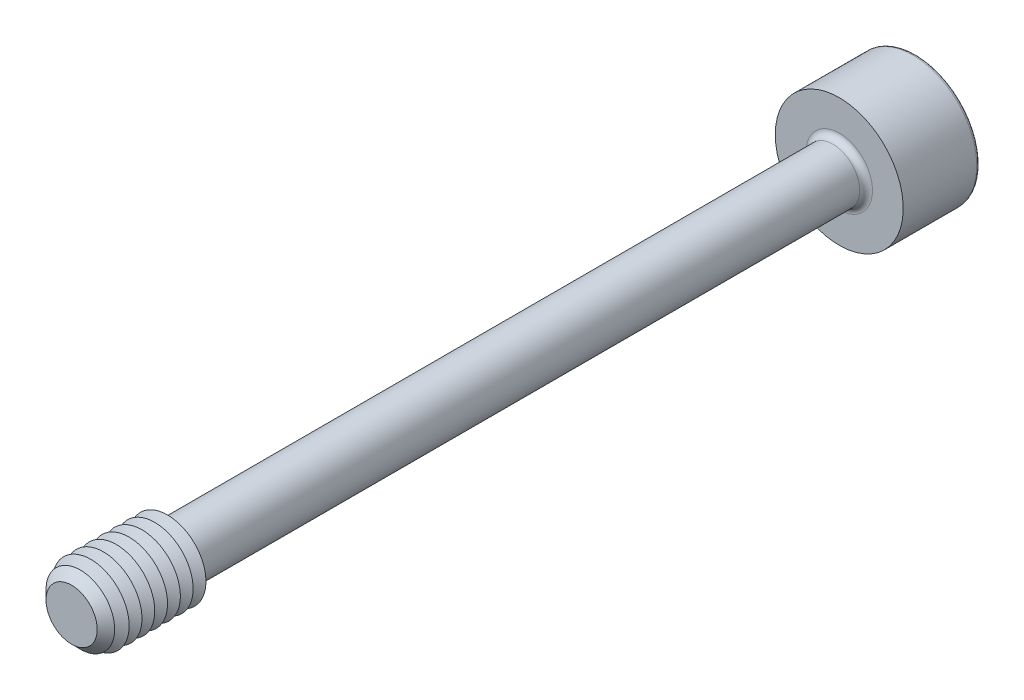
ISO-10303-21;
HEADER;
FILE_DESCRIPTION(('STEP AP214'),'2;1');
FILE_NAME('part.step','',(''),(''),'','','');
FILE_SCHEMA(('AUTOMOTIVE_DESIGN { 1 0 10303 214 1 1 1 1 }'));
ENDSEC;
DATA;
#1=APPLICATION_CONTEXT('core data for automotive mechanical design processes');
#2=APPLICATION_PROTOCOL_DEFINITION('international standard','automotive_design',2000,#1);
#3=PRODUCT_CONTEXT('',#1,'mechanical');
#4=PRODUCT('Part','Part','',(#3));
#5=PRODUCT_RELATED_PRODUCT_CATEGORY('part','',(#4));
#6=PRODUCT_DEFINITION_FORMATION('','',#4);
#7=PRODUCT_DEFINITION_CONTEXT('part definition',#1,'design');
#8=PRODUCT_DEFINITION('design','',#6,#7);
#9=PRODUCT_DEFINITION_SHAPE('','',#8);
#10=(LENGTH_UNIT() NAMED_UNIT(*) SI_UNIT(.MILLI.,.METRE.));
#11=(NAMED_UNIT(*) PLANE_ANGLE_UNIT() SI_UNIT($,.RADIAN.));
#12=(NAMED_UNIT(*) SI_UNIT($,.STERADIAN.) SOLID_ANGLE_UNIT());
#13=UNCERTAINTY_MEASURE_WITH_UNIT(LENGTH_MEASURE(1.E-05),#10,'distance_accuracy_value','');
#14=(GEOMETRIC_REPRESENTATION_CONTEXT(3) GLOBAL_UNCERTAINTY_ASSIGNED_CONTEXT((#13)) GLOBAL_UNIT_ASSIGNED_CONTEXT((#10,
#11,#12)) REPRESENTATION_CONTEXT('',''));
#15=CARTESIAN_POINT('',(0.,0.,0.));
#16=DIRECTION('',(0.,0.,1.));
#17=DIRECTION('',(1.,0.,0.));
#18=AXIS2_PLACEMENT_3D('',#15,#16,#17);
#19=CARTESIAN_POINT('',(-1.44337567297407,-2.5,-31.));
#20=DIRECTION('',(0.,0.,1.));
#21=DIRECTION('',(1.,0.,0.));
#22=AXIS2_PLACEMENT_3D('',#19,#20,#21);
#23=PLANE('',#22);
#24=DIRECTION('',(1.,0.,0.));
#25=VECTOR('',#24,1.);
#26=CARTESIAN_POINT('',(-1.44337567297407,-2.5,-31.));
#27=LINE('',#26,#25);
#28=CARTESIAN_POINT('',(0.,-2.5,-31.));
#29=VERTEX_POINT('',#28);
#30=CARTESIAN_POINT('',(1.44337567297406,-2.5,-31.));
#31=VERTEX_POINT('',#30);
#32=EDGE_CURVE('E729',#29,#31,#27,.T.);
#33=ORIENTED_EDGE('',*,*,#32,.F.);
#34=CARTESIAN_POINT('',(0.,0.,-31.));
#35=DIRECTION('',(0.,0.,1.));
#36=DIRECTION('',(0.,-1.,0.));
#37=AXIS2_PLACEMENT_3D('',#34,#35,#36);
#38=CIRCLE('',#37,2.5);
#39=CARTESIAN_POINT('',(2.1650635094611,-1.25,-31.));
#40=VERTEX_POINT('',#39);
#41=EDGE_CURVE('E53',#29,#40,#38,.T.);
#42=ORIENTED_EDGE('',*,*,#41,.T.);
#43=DIRECTION('',(0.5,0.866025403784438,0.));
#44=VECTOR('',#43,1.);
#45=CARTESIAN_POINT('',(1.44337567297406,-2.5,-31.));
#46=LINE('',#45,#44);
#47=EDGE_CURVE('E714',#31,#40,#46,.T.);
#48=ORIENTED_EDGE('',*,*,#47,.F.);
#49=EDGE_LOOP('',(#33,#42,#48));
#50=FACE_BOUND('',#49,.T.);
#51=ADVANCED_FACE('F41',(#50),#23,.F.);
#52=CARTESIAN_POINT('',(2.88675134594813,0.,-31.));
#53=VERTEX_POINT('',#52);
#54=EDGE_CURVE('E725',#40,#53,#46,.T.);
#55=ORIENTED_EDGE('',*,*,#54,.F.);
#56=CARTESIAN_POINT('',(2.1650635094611,1.25,-31.));
#57=VERTEX_POINT('',#56);
#58=EDGE_CURVE('E11',#40,#57,#38,.T.);
#59=ORIENTED_EDGE('',*,*,#58,.T.);
#60=DIRECTION('',(-0.5,0.866025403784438,0.));
#61=VECTOR('',#60,1.);
#62=CARTESIAN_POINT('',(2.88675134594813,0.,-31.));
#63=LINE('',#62,#61);
#64=EDGE_CURVE('E713',#53,#57,#63,.T.);
#65=ORIENTED_EDGE('',*,*,#64,.F.);
#66=EDGE_LOOP('',(#55,#59,#65));
#67=FACE_BOUND('',#66,.T.);
#68=ADVANCED_FACE('F133',(#67),#23,.F.);
#69=CARTESIAN_POINT('',(1.44337567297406,2.5,-31.));
#70=VERTEX_POINT('',#69);
#71=EDGE_CURVE('E708',#57,#70,#63,.T.);
#72=ORIENTED_EDGE('',*,*,#71,.F.);
#73=CARTESIAN_POINT('',(0.,2.5,-31.));
#74=VERTEX_POINT('',#73);
#75=EDGE_CURVE('E51',#57,#74,#38,.T.);
#76=ORIENTED_EDGE('',*,*,#75,.T.);
#77=DIRECTION('',(-1.,0.,0.));
#78=VECTOR('',#77,1.);
#79=CARTESIAN_POINT('',(1.44337567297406,2.5,-31.));
#80=LINE('',#79,#78);
#81=EDGE_CURVE('E177',#70,#74,#80,.T.);
#82=ORIENTED_EDGE('',*,*,#81,.F.);
#83=EDGE_LOOP('',(#72,#76,#82));
#84=FACE_BOUND('',#83,.T.);
#85=ADVANCED_FACE('F139',(#84),#23,.F.);
#86=CARTESIAN_POINT('',(-1.44337567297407,2.5,-31.));
#87=VERTEX_POINT('',#86);
#88=EDGE_CURVE('E719',#74,#87,#80,.T.);
#89=ORIENTED_EDGE('',*,*,#88,.F.);
#90=CARTESIAN_POINT('',(-2.1650635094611,1.25,-31.));
#91=VERTEX_POINT('',#90);
#92=EDGE_CURVE('E263',#74,#91,#38,.T.);
#93=ORIENTED_EDGE('',*,*,#92,.T.);
#94=DIRECTION('',(-0.5,-0.866025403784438,0.));
#95=VECTOR('',#94,1.);
#96=CARTESIAN_POINT('',(-1.44337567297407,2.5,-31.));
#97=LINE('',#96,#95);
#98=EDGE_CURVE('E176',#87,#91,#97,.T.);
#99=ORIENTED_EDGE('',*,*,#98,.F.);
#100=EDGE_LOOP('',(#89,#93,#99));
#101=FACE_BOUND('',#100,.T.);
#102=ADVANCED_FACE('F157',(#101),#23,.F.);
#103=CARTESIAN_POINT('',(-2.88675134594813,0.,-31.));
#104=VERTEX_POINT('',#103);
#105=EDGE_CURVE('E170',#91,#104,#97,.T.);
#106=ORIENTED_EDGE('',*,*,#105,.F.);
#107=CARTESIAN_POINT('',(-2.1650635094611,-1.25,-31.));
#108=VERTEX_POINT('',#107);
#109=EDGE_CURVE('E172',#91,#108,#38,.T.);
#110=ORIENTED_EDGE('',*,*,#109,.T.);
#111=DIRECTION('',(0.5,-0.866025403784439,0.));
#112=VECTOR('',#111,1.);
#113=CARTESIAN_POINT('',(-2.88675134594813,0.,-31.));
#114=LINE('',#113,#112);
#115=EDGE_CURVE('E174',#104,#108,#114,.T.);
#116=ORIENTED_EDGE('',*,*,#115,.F.);
#117=EDGE_LOOP('',(#106,#110,#116));
#118=FACE_BOUND('',#117,.T.);
#119=ADVANCED_FACE('F146',(#118),#23,.F.);
#120=CARTESIAN_POINT('',(0.,0.,-36.));
#121=DIRECTION('',(0.,0.,-1.));
#122=DIRECTION('',(-1.,0.,0.));
#123=AXIS2_PLACEMENT_3D('',#120,#121,#122);
#124=PLANE('',#123);
#125=CARTESIAN_POINT('',(0.,0.,-36.));
#126=DIRECTION('',(0.,0.,-1.));
#127=DIRECTION('',(-1.,0.,0.));
#128=AXIS2_PLACEMENT_3D('',#125,#126,#127);
#129=CIRCLE('',#128,4.75);
#130=CARTESIAN_POINT('',(-4.75,0.,-36.));
#131=VERTEX_POINT('',#130);
#132=EDGE_CURVE('E250',#131,#131,#129,.T.);
#133=ORIENTED_EDGE('',*,*,#132,.T.);
#134=EDGE_LOOP('',(#133));
#135=FACE_BOUND('',#134,.T.);
#136=DIRECTION('',(-0.5,-0.866025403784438,0.));
#137=VECTOR('',#136,1.);
#138=CARTESIAN_POINT('',(-1.44337567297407,2.5,-36.));
#139=LINE('',#138,#137);
#140=CARTESIAN_POINT('',(-1.44337567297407,2.5,-36.));
#141=VERTEX_POINT('',#140);
#142=CARTESIAN_POINT('',(-2.88675134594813,0.,-36.));
#143=VERTEX_POINT('',#142);
#144=EDGE_CURVE('E211',#141,#143,#139,.T.);
#145=ORIENTED_EDGE('',*,*,#144,.T.);
#146=DIRECTION('',(0.5,-0.866025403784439,0.));
#147=VECTOR('',#146,1.);
#148=CARTESIAN_POINT('',(-2.88675134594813,0.,-36.));
#149=LINE('',#148,#147);
#150=CARTESIAN_POINT('',(-1.44337567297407,-2.5,-36.));
#151=VERTEX_POINT('',#150);
#152=EDGE_CURVE('E67',#143,#151,#149,.T.);
#153=ORIENTED_EDGE('',*,*,#152,.T.);
#154=DIRECTION('',(1.,0.,0.));
#155=VECTOR('',#154,1.);
#156=CARTESIAN_POINT('',(-1.44337567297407,-2.5,-36.));
#157=LINE('',#156,#155);
#158=CARTESIAN_POINT('',(1.44337567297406,-2.5,-36.));
#159=VERTEX_POINT('',#158);
#160=EDGE_CURVE('E195',#151,#159,#157,.T.);
#161=ORIENTED_EDGE('',*,*,#160,.T.);
#162=DIRECTION('',(0.5,0.866025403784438,0.));
#163=VECTOR('',#162,1.);
#164=CARTESIAN_POINT('',(1.44337567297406,-2.5,-36.));
#165=LINE('',#164,#163);
#166=CARTESIAN_POINT('',(2.88675134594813,0.,-36.));
#167=VERTEX_POINT('',#166);
#168=EDGE_CURVE('E199',#159,#167,#165,.T.);
#169=ORIENTED_EDGE('',*,*,#168,.T.);
#170=DIRECTION('',(-0.5,0.866025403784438,0.));
#171=VECTOR('',#170,1.);
#172=CARTESIAN_POINT('',(2.88675134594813,0.,-36.));
#173=LINE('',#172,#171);
#174=CARTESIAN_POINT('',(1.44337567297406,2.5,-36.));
#175=VERTEX_POINT('',#174);
#176=EDGE_CURVE('E203',#167,#175,#173,.T.);
#177=ORIENTED_EDGE('',*,*,#176,.T.);
#178=DIRECTION('',(-1.,0.,0.));
#179=VECTOR('',#178,1.);
#180=CARTESIAN_POINT('',(1.44337567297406,2.5,-36.));
#181=LINE('',#180,#179);
#182=EDGE_CURVE('E207',#175,#141,#181,.T.);
#183=ORIENTED_EDGE('',*,*,#182,.T.);
#184=EDGE_LOOP('',(#145,#153,#161,#169,#177,#183));
#185=FACE_BOUND('',#184,.T.);
#186=ADVANCED_FACE('F156',(#135,#185),#124,.T.);
#187=CARTESIAN_POINT('',(0.,0.,30.));
#188=DIRECTION('',(0.,0.,-1.));
#189=DIRECTION('',(-1.,0.,0.));
#190=AXIS2_PLACEMENT_3D('',#187,#188,#189);
#191=CYLINDRICAL_SURFACE('',#190,2.1);
#192=CARTESIAN_POINT('',(0.,0.,-29.5));
#193=DIRECTION('',(0.,0.,-1.));
#194=DIRECTION('',(-1.,0.,0.));
#195=AXIS2_PLACEMENT_3D('',#192,#193,#194);
#196=CIRCLE('',#195,2.1);
#197=CARTESIAN_POINT('',(-2.1,0.,-29.5));
#198=VERTEX_POINT('',#197);
#199=EDGE_CURVE('E246',#198,#198,#196,.F.);
#200=ORIENTED_EDGE('',*,*,#199,.T.);
#201=EDGE_LOOP('',(#200));
#202=FACE_BOUND('',#201,.T.);
#203=CARTESIAN_POINT('',(0.,0.,21.9803847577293));
#204=DIRECTION('',(0.,0.,-1.));
#205=DIRECTION('',(0.,1.,0.));
#206=AXIS2_PLACEMENT_3D('',#203,#204,#205);
#207=CIRCLE('',#206,2.1);
#208=CARTESIAN_POINT('',(0.,2.1,21.9803847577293));
#209=VERTEX_POINT('',#208);
#210=EDGE_CURVE('E234',#209,#209,#207,.T.);
#211=ORIENTED_EDGE('',*,*,#210,.T.);
#212=EDGE_LOOP('',(#211));
#213=FACE_BOUND('',#212,.T.);
#214=ADVANCED_FACE('F163',(#202,#213),#191,.T.);
#215=CARTESIAN_POINT('',(0.,0.,21.9803847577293));
#216=DIRECTION('',(0.,0.,1.));
#217=DIRECTION('',(0.,-1.,0.));
#218=AXIS2_PLACEMENT_3D('',#215,#216,#217);
#219=CONICAL_SURFACE('',#218,2.1,1.0471975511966);
#220=CARTESIAN_POINT('',(0.,0.,22.5));
#221=DIRECTION('',(0.,0.,-1.));
#222=DIRECTION('',(-1.,0.,0.));
#223=AXIS2_PLACEMENT_3D('',#220,#221,#222);
#224=CIRCLE('',#223,3.);
#225=CARTESIAN_POINT('',(-3.,0.,22.5));
#226=VERTEX_POINT('',#225);
#227=EDGE_CURVE('E267',#226,#226,#224,.T.);
#228=ORIENTED_EDGE('',*,*,#227,.T.);
#229=EDGE_LOOP('',(#228));
#230=FACE_BOUND('',#229,.T.);
#231=ORIENTED_EDGE('',*,*,#210,.F.);
#232=EDGE_LOOP('',(#231));
#233=FACE_BOUND('',#232,.T.);
#234=ADVANCED_FACE('F485',(#230,#233),#219,.T.);
#235=CARTESIAN_POINT('',(0.,0.,-30.));
#236=DIRECTION('',(0.,0.,-1.));
#237=DIRECTION('',(-1.,0.,0.));
#238=AXIS2_PLACEMENT_3D('',#235,#236,#237);
#239=PLANE('',#238);
#240=CARTESIAN_POINT('',(0.,0.,-30.));
#241=DIRECTION('',(0.,0.,-1.));
#242=DIRECTION('',(-1.,0.,0.));
#243=AXIS2_PLACEMENT_3D('',#240,#241,#242);
#244=CIRCLE('',#243,2.6);
#245=CARTESIAN_POINT('',(-2.6,0.,-30.));
#246=VERTEX_POINT('',#245);
#247=EDGE_CURVE('E242',#246,#246,#244,.T.);
#248=ORIENTED_EDGE('',*,*,#247,.T.);
#249=EDGE_LOOP('',(#248));
#250=FACE_BOUND('',#249,.T.);
#251=CARTESIAN_POINT('',(0.,0.,-30.));
#252=DIRECTION('',(0.,0.,-1.));
#253=DIRECTION('',(-1.,0.,0.));
#254=AXIS2_PLACEMENT_3D('',#251,#252,#253);
#255=CIRCLE('',#254,5.);
#256=CARTESIAN_POINT('',(-5.,0.,-30.));
#257=VERTEX_POINT('',#256);
#258=EDGE_CURVE('E230',#257,#257,#255,.T.);
#259=ORIENTED_EDGE('',*,*,#258,.F.);
#260=EDGE_LOOP('',(#259));
#261=FACE_BOUND('',#260,.T.);
#262=ADVANCED_FACE('F478',(#250,#261),#239,.F.);
#263=CARTESIAN_POINT('',(0.,0.,-36.));
#264=DIRECTION('',(0.,0.,1.));
#265=DIRECTION('',(1.,0.,0.));
#266=AXIS2_PLACEMENT_3D('',#263,#264,#265);
#267=CYLINDRICAL_SURFACE('',#266,5.);
#268=CARTESIAN_POINT('',(0.,0.,-35.75));
#269=DIRECTION('',(0.,0.,-1.));
#270=DIRECTION('',(-1.,0.,0.));
#271=AXIS2_PLACEMENT_3D('',#268,#269,#270);
#272=CIRCLE('',#271,5.);
#273=CARTESIAN_POINT('',(-5.,0.,-35.75));
#274=VERTEX_POINT('',#273);
#275=EDGE_CURVE('E253',#274,#274,#272,.F.);
#276=ORIENTED_EDGE('',*,*,#275,.T.);
#277=EDGE_LOOP('',(#276));
#278=FACE_BOUND('',#277,.T.);
#279=ORIENTED_EDGE('',*,*,#258,.T.);
#280=EDGE_LOOP('',(#279));
#281=FACE_BOUND('',#280,.T.);
#282=ADVANCED_FACE('F484',(#278,#281),#267,.T.);
#283=CARTESIAN_POINT('',(-2.88675134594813,0.,-31.));
#284=DIRECTION('',(0.866025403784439,0.5,0.));
#285=DIRECTION('',(-0.5,0.866025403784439,0.));
#286=AXIS2_PLACEMENT_3D('',#283,#284,#285);
#287=PLANE('',#286);
#288=ORIENTED_EDGE('',*,*,#152,.F.);
#289=DIRECTION('',(0.,0.,-1.));
#290=VECTOR('',#289,1.);
#291=CARTESIAN_POINT('',(-2.88675134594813,0.,-31.));
#292=LINE('',#291,#290);
#293=EDGE_CURVE('E186',#104,#143,#292,.T.);
#294=ORIENTED_EDGE('',*,*,#293,.F.);
#295=ORIENTED_EDGE('',*,*,#115,.T.);
#296=CARTESIAN_POINT('',(-1.44337567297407,-2.5,-31.));
#297=VERTEX_POINT('',#296);
#298=EDGE_CURVE('E214',#108,#297,#114,.T.);
#299=ORIENTED_EDGE('',*,*,#298,.T.);
#300=DIRECTION('',(0.,0.,-1.));
#301=VECTOR('',#300,1.);
#302=CARTESIAN_POINT('',(-1.44337567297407,-2.5,-31.));
#303=LINE('',#302,#301);
#304=EDGE_CURVE('E227',#297,#151,#303,.T.);
#305=ORIENTED_EDGE('',*,*,#304,.T.);
#306=EDGE_LOOP('',(#288,#294,#295,#299,#305));
#307=FACE_BOUND('',#306,.T.);
#308=ADVANCED_FACE('F496',(#307),#287,.T.);
#309=CARTESIAN_POINT('',(-1.44337567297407,-2.5,-31.));
#310=DIRECTION('',(0.,1.,0.));
#311=DIRECTION('',(-1.,0.,0.));
#312=AXIS2_PLACEMENT_3D('',#309,#310,#311);
#313=PLANE('',#312);
#314=ORIENTED_EDGE('',*,*,#160,.F.);
#315=ORIENTED_EDGE('',*,*,#304,.F.);
#316=EDGE_CURVE('E726',#297,#29,#27,.T.);
#317=ORIENTED_EDGE('',*,*,#316,.T.);
#318=ORIENTED_EDGE('',*,*,#32,.T.);
#319=DIRECTION('',(0.,0.,-1.));
#320=VECTOR('',#319,1.);
#321=CARTESIAN_POINT('',(1.44337567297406,-2.5,-31.));
#322=LINE('',#321,#320);
#323=EDGE_CURVE('E224',#31,#159,#322,.T.);
#324=ORIENTED_EDGE('',*,*,#323,.T.);
#325=EDGE_LOOP('',(#314,#315,#317,#318,#324));
#326=FACE_BOUND('',#325,.T.);
#327=ADVANCED_FACE('F512',(#326),#313,.T.);
#328=CARTESIAN_POINT('',(1.44337567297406,-2.5,-31.));
#329=DIRECTION('',(-0.866025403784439,0.5,0.));
#330=DIRECTION('',(-0.5,-0.866025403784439,0.));
#331=AXIS2_PLACEMENT_3D('',#328,#329,#330);
#332=PLANE('',#331);
#333=ORIENTED_EDGE('',*,*,#168,.F.);
#334=ORIENTED_EDGE('',*,*,#323,.F.);
#335=ORIENTED_EDGE('',*,*,#47,.T.);
#336=ORIENTED_EDGE('',*,*,#54,.T.);
#337=DIRECTION('',(0.,0.,-1.));
#338=VECTOR('',#337,1.);
#339=CARTESIAN_POINT('',(2.88675134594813,0.,-31.));
#340=LINE('',#339,#338);
#341=EDGE_CURVE('E221',#53,#167,#340,.T.);
#342=ORIENTED_EDGE('',*,*,#341,.T.);
#343=EDGE_LOOP('',(#333,#334,#335,#336,#342));
#344=FACE_BOUND('',#343,.T.);
#345=ADVANCED_FACE('F522',(#344),#332,.T.);
#346=CARTESIAN_POINT('',(2.88675134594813,0.,-31.));
#347=DIRECTION('',(-0.866025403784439,-0.5,0.));
#348=DIRECTION('',(0.5,-0.866025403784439,0.));
#349=AXIS2_PLACEMENT_3D('',#346,#347,#348);
#350=PLANE('',#349);
#351=ORIENTED_EDGE('',*,*,#176,.F.);
#352=ORIENTED_EDGE('',*,*,#341,.F.);
#353=ORIENTED_EDGE('',*,*,#64,.T.);
#354=ORIENTED_EDGE('',*,*,#71,.T.);
#355=DIRECTION('',(0.,0.,-1.));
#356=VECTOR('',#355,1.);
#357=CARTESIAN_POINT('',(1.44337567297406,2.5,-31.));
#358=LINE('',#357,#356);
#359=EDGE_CURVE('E218',#70,#175,#358,.T.);
#360=ORIENTED_EDGE('',*,*,#359,.T.);
#361=EDGE_LOOP('',(#351,#352,#353,#354,#360));
#362=FACE_BOUND('',#361,.T.);
#363=ADVANCED_FACE('F532',(#362),#350,.T.);
#364=CARTESIAN_POINT('',(1.44337567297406,2.5,-31.));
#365=DIRECTION('',(0.,-1.,0.));
#366=DIRECTION('',(0.,0.,-1.));
#367=AXIS2_PLACEMENT_3D('',#364,#365,#366);
#368=PLANE('',#367);
#369=ORIENTED_EDGE('',*,*,#182,.F.);
#370=ORIENTED_EDGE('',*,*,#359,.F.);
#371=ORIENTED_EDGE('',*,*,#81,.T.);
#372=ORIENTED_EDGE('',*,*,#88,.T.);
#373=DIRECTION('',(0.,0.,-1.));
#374=VECTOR('',#373,1.);
#375=CARTESIAN_POINT('',(-1.44337567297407,2.5,-31.));
#376=LINE('',#375,#374);
#377=EDGE_CURVE('E182',#87,#141,#376,.T.);
#378=ORIENTED_EDGE('',*,*,#377,.T.);
#379=EDGE_LOOP('',(#369,#370,#371,#372,#378));
#380=FACE_BOUND('',#379,.T.);
#381=ADVANCED_FACE('F152',(#380),#368,.T.);
#382=CARTESIAN_POINT('',(-1.44337567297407,2.5,-31.));
#383=DIRECTION('',(0.866025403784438,-0.5,0.));
#384=DIRECTION('',(0.5,0.866025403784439,0.));
#385=AXIS2_PLACEMENT_3D('',#382,#383,#384);
#386=PLANE('',#385);
#387=ORIENTED_EDGE('',*,*,#144,.F.);
#388=ORIENTED_EDGE('',*,*,#377,.F.);
#389=ORIENTED_EDGE('',*,*,#98,.T.);
#390=ORIENTED_EDGE('',*,*,#105,.T.);
#391=ORIENTED_EDGE('',*,*,#293,.T.);
#392=EDGE_LOOP('',(#387,#388,#389,#390,#391));
#393=FACE_BOUND('',#392,.T.);
#394=ADVANCED_FACE('F144',(#393),#386,.T.);
#395=ORIENTED_EDGE('',*,*,#298,.F.);
#396=EDGE_CURVE('E255',#108,#29,#38,.T.);
#397=ORIENTED_EDGE('',*,*,#396,.T.);
#398=ORIENTED_EDGE('',*,*,#316,.F.);
#399=EDGE_LOOP('',(#395,#397,#398));
#400=FACE_BOUND('',#399,.T.);
#401=ADVANCED_FACE('F135',(#400),#23,.F.);
#402=CARTESIAN_POINT('',(0.,0.,-29.5));
#403=DIRECTION('',(0.,0.,-1.));
#404=DIRECTION('',(-1.,0.,0.));
#405=AXIS2_PLACEMENT_3D('',#402,#403,#404);
#406=TOROIDAL_SURFACE('',#405,2.6,0.5);
#407=ORIENTED_EDGE('',*,*,#199,.F.);
#408=EDGE_LOOP('',(#407));
#409=FACE_BOUND('',#408,.T.);
#410=ORIENTED_EDGE('',*,*,#247,.F.);
#411=EDGE_LOOP('',(#410));
#412=FACE_BOUND('',#411,.T.);
#413=ADVANCED_FACE('F129',(#409,#412),#406,.F.);
#414=CARTESIAN_POINT('',(0.,0.,-35.75));
#415=DIRECTION('',(0.,0.,-1.));
#416=DIRECTION('',(-1.,0.,0.));
#417=AXIS2_PLACEMENT_3D('',#414,#415,#416);
#418=TOROIDAL_SURFACE('',#417,4.75,0.25);
#419=ORIENTED_EDGE('',*,*,#275,.F.);
#420=EDGE_LOOP('',(#419));
#421=FACE_BOUND('',#420,.T.);
#422=ORIENTED_EDGE('',*,*,#132,.F.);
#423=EDGE_LOOP('',(#422));
#424=FACE_BOUND('',#423,.T.);
#425=ADVANCED_FACE('F43',(#421,#424),#418,.T.);
#426=CARTESIAN_POINT('',(0.,0.,-29.556624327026));
#427=DIRECTION('',(0.,0.,-1.));
#428=DIRECTION('',(0.,1.,0.));
#429=AXIS2_PLACEMENT_3D('',#426,#427,#428);
#430=CONICAL_SURFACE('',#429,0.,1.0471975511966);
#431=ORIENTED_EDGE('',*,*,#41,.F.);
#432=ORIENTED_EDGE('',*,*,#396,.F.);
#433=ORIENTED_EDGE('',*,*,#109,.F.);
#434=ORIENTED_EDGE('',*,*,#92,.F.);
#435=ORIENTED_EDGE('',*,*,#75,.F.);
#436=ORIENTED_EDGE('',*,*,#58,.F.);
#437=EDGE_LOOP('',(#431,#432,#433,#434,#435,#436));
#438=FACE_BOUND('',#437,.T.);
#439=CARTESIAN_POINT('',(0.,0.,-29.556624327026));
#440=VERTEX_POINT('',#439);
#441=VERTEX_LOOP('',#440);
#442=FACE_BOUND('',#441,.T.);
#443=ADVANCED_FACE('F118',(#438,#442),#430,.F.);
#444=CARTESIAN_POINT('',(0.,0.,23.));
#445=DIRECTION('',(0.,0.,-1.));
#446=DIRECTION('',(-1.,0.,0.));
#447=AXIS2_PLACEMENT_3D('',#444,#445,#446);
#448=CONICAL_SURFACE('',#447,2.13397459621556,1.0471975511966);
#449=ORIENTED_EDGE('',*,*,#227,.F.);
#450=EDGE_LOOP('',(#449));
#451=FACE_BOUND('',#450,.T.);
#452=CARTESIAN_POINT('',(0.,0.,23.));
#453=DIRECTION('',(0.,0.,-1.));
#454=DIRECTION('',(-1.,0.,0.));
#455=AXIS2_PLACEMENT_3D('',#452,#453,#454);
#456=CIRCLE('',#455,2.13397459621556);
#457=CARTESIAN_POINT('',(-2.13397459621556,0.,23.));
#458=VERTEX_POINT('',#457);
#459=EDGE_CURVE('E273',#458,#458,#456,.T.);
#460=ORIENTED_EDGE('',*,*,#459,.T.);
#461=EDGE_LOOP('',(#460));
#462=FACE_BOUND('',#461,.T.);
#463=ADVANCED_FACE('F120',(#451,#462),#448,.T.);
#464=CARTESIAN_POINT('',(0.,0.,23.5));
#465=DIRECTION('',(0.,0.,1.));
#466=DIRECTION('',(1.,0.,0.));
#467=AXIS2_PLACEMENT_3D('',#464,#465,#466);
#468=CONICAL_SURFACE('',#467,3.,1.0471975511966);
#469=ORIENTED_EDGE('',*,*,#459,.F.);
#470=EDGE_LOOP('',(#469));
#471=FACE_BOUND('',#470,.T.);
#472=CARTESIAN_POINT('',(0.,0.,23.5));
#473=DIRECTION('',(0.,0.,-1.));
#474=DIRECTION('',(-1.,0.,0.));
#475=AXIS2_PLACEMENT_3D('',#472,#473,#474);
#476=CIRCLE('',#475,3.);
#477=CARTESIAN_POINT('',(-3.,0.,23.5));
#478=VERTEX_POINT('',#477);
#479=EDGE_CURVE('E279',#478,#478,#476,.T.);
#480=ORIENTED_EDGE('',*,*,#479,.T.);
#481=EDGE_LOOP('',(#480));
#482=FACE_BOUND('',#481,.T.);
#483=ADVANCED_FACE('F126',(#471,#482),#468,.T.);
#484=CARTESIAN_POINT('',(0.,0.,24.));
#485=DIRECTION('',(0.,0.,-1.));
#486=DIRECTION('',(-1.,0.,0.));
#487=AXIS2_PLACEMENT_3D('',#484,#485,#486);
#488=CONICAL_SURFACE('',#487,2.13397459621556,1.0471975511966);
#489=ORIENTED_EDGE('',*,*,#479,.F.);
#490=EDGE_LOOP('',(#489));
#491=FACE_BOUND('',#490,.T.);
#492=CARTESIAN_POINT('',(0.,0.,24.));
#493=DIRECTION('',(0.,0.,-1.));
#494=DIRECTION('',(-1.,0.,0.));
#495=AXIS2_PLACEMENT_3D('',#492,#493,#494);
#496=CIRCLE('',#495,2.13397459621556);
#497=CARTESIAN_POINT('',(-2.13397459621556,0.,24.));
#498=VERTEX_POINT('',#497);
#499=EDGE_CURVE('E284',#498,#498,#496,.T.);
#500=ORIENTED_EDGE('',*,*,#499,.T.);
#501=EDGE_LOOP('',(#500));
#502=FACE_BOUND('',#501,.T.);
#503=ADVANCED_FACE('F382',(#491,#502),#488,.T.);
#504=CARTESIAN_POINT('',(0.,0.,24.5));
#505=DIRECTION('',(0.,0.,1.));
#506=DIRECTION('',(1.,0.,0.));
#507=AXIS2_PLACEMENT_3D('',#504,#505,#506);
#508=CONICAL_SURFACE('',#507,3.,1.0471975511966);
#509=ORIENTED_EDGE('',*,*,#499,.F.);
#510=EDGE_LOOP('',(#509));
#511=FACE_BOUND('',#510,.T.);
#512=CARTESIAN_POINT('',(0.,0.,24.5));
#513=DIRECTION('',(0.,0.,-1.));
#514=DIRECTION('',(-1.,0.,0.));
#515=AXIS2_PLACEMENT_3D('',#512,#513,#514);
#516=CIRCLE('',#515,3.);
#517=CARTESIAN_POINT('',(-3.,0.,24.5));
#518=VERTEX_POINT('',#517);
#519=EDGE_CURVE('E288',#518,#518,#516,.T.);
#520=ORIENTED_EDGE('',*,*,#519,.T.);
#521=EDGE_LOOP('',(#520));
#522=FACE_BOUND('',#521,.T.);
#523=ADVANCED_FACE('F378',(#511,#522),#508,.T.);
#524=CARTESIAN_POINT('',(0.,0.,25.));
#525=DIRECTION('',(0.,0.,-1.));
#526=DIRECTION('',(-1.,0.,0.));
#527=AXIS2_PLACEMENT_3D('',#524,#525,#526);
#528=CONICAL_SURFACE('',#527,2.13397459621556,1.0471975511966);
#529=ORIENTED_EDGE('',*,*,#519,.F.);
#530=EDGE_LOOP('',(#529));
#531=FACE_BOUND('',#530,.T.);
#532=CARTESIAN_POINT('',(0.,0.,25.));
#533=DIRECTION('',(0.,0.,-1.));
#534=DIRECTION('',(-1.,0.,0.));
#535=AXIS2_PLACEMENT_3D('',#532,#533,#534);
#536=CIRCLE('',#535,2.13397459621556);
#537=CARTESIAN_POINT('',(-2.13397459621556,0.,25.));
#538=VERTEX_POINT('',#537);
#539=EDGE_CURVE('E292',#538,#538,#536,.T.);
#540=ORIENTED_EDGE('',*,*,#539,.T.);
#541=EDGE_LOOP('',(#540));
#542=FACE_BOUND('',#541,.T.);
#543=ADVANCED_FACE('F374',(#531,#542),#528,.T.);
#544=CARTESIAN_POINT('',(0.,0.,25.5));
#545=DIRECTION('',(0.,0.,1.));
#546=DIRECTION('',(1.,0.,0.));
#547=AXIS2_PLACEMENT_3D('',#544,#545,#546);
#548=CONICAL_SURFACE('',#547,3.,1.0471975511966);
#549=ORIENTED_EDGE('',*,*,#539,.F.);
#550=EDGE_LOOP('',(#549));
#551=FACE_BOUND('',#550,.T.);
#552=CARTESIAN_POINT('',(0.,0.,25.5));
#553=DIRECTION('',(0.,0.,-1.));
#554=DIRECTION('',(-1.,0.,0.));
#555=AXIS2_PLACEMENT_3D('',#552,#553,#554);
#556=CIRCLE('',#555,3.);
#557=CARTESIAN_POINT('',(-3.,0.,25.5));
#558=VERTEX_POINT('',#557);
#559=EDGE_CURVE('E295',#558,#558,#556,.T.);
#560=ORIENTED_EDGE('',*,*,#559,.T.);
#561=EDGE_LOOP('',(#560));
#562=FACE_BOUND('',#561,.T.);
#563=ADVANCED_FACE('F370',(#551,#562),#548,.T.);
#564=CARTESIAN_POINT('',(0.,0.,26.));
#565=DIRECTION('',(0.,0.,-1.));
#566=DIRECTION('',(-1.,0.,0.));
#567=AXIS2_PLACEMENT_3D('',#564,#565,#566);
#568=CONICAL_SURFACE('',#567,2.13397459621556,1.0471975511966);
#569=ORIENTED_EDGE('',*,*,#559,.F.);
#570=EDGE_LOOP('',(#569));
#571=FACE_BOUND('',#570,.T.);
#572=CARTESIAN_POINT('',(0.,0.,26.));
#573=DIRECTION('',(0.,0.,-1.));
#574=DIRECTION('',(-1.,0.,0.));
#575=AXIS2_PLACEMENT_3D('',#572,#573,#574);
#576=CIRCLE('',#575,2.13397459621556);
#577=CARTESIAN_POINT('',(-2.13397459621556,0.,26.));
#578=VERTEX_POINT('',#577);
#579=EDGE_CURVE('E299',#578,#578,#576,.T.);
#580=ORIENTED_EDGE('',*,*,#579,.T.);
#581=EDGE_LOOP('',(#580));
#582=FACE_BOUND('',#581,.T.);
#583=ADVANCED_FACE('F366',(#571,#582),#568,.T.);
#584=CARTESIAN_POINT('',(0.,0.,26.5));
#585=DIRECTION('',(0.,0.,1.));
#586=DIRECTION('',(1.,0.,0.));
#587=AXIS2_PLACEMENT_3D('',#584,#585,#586);
#588=CONICAL_SURFACE('',#587,3.,1.0471975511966);
#589=ORIENTED_EDGE('',*,*,#579,.F.);
#590=EDGE_LOOP('',(#589));
#591=FACE_BOUND('',#590,.T.);
#592=CARTESIAN_POINT('',(0.,0.,26.5));
#593=DIRECTION('',(0.,0.,-1.));
#594=DIRECTION('',(-1.,0.,0.));
#595=AXIS2_PLACEMENT_3D('',#592,#593,#594);
#596=CIRCLE('',#595,3.);
#597=CARTESIAN_POINT('',(-3.,0.,26.5));
#598=VERTEX_POINT('',#597);
#599=EDGE_CURVE('E303',#598,#598,#596,.T.);
#600=ORIENTED_EDGE('',*,*,#599,.T.);
#601=EDGE_LOOP('',(#600));
#602=FACE_BOUND('',#601,.T.);
#603=ADVANCED_FACE('F362',(#591,#602),#588,.T.);
#604=CARTESIAN_POINT('',(0.,0.,27.));
#605=DIRECTION('',(0.,0.,-1.));
#606=DIRECTION('',(-1.,0.,0.));
#607=AXIS2_PLACEMENT_3D('',#604,#605,#606);
#608=CONICAL_SURFACE('',#607,2.13397459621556,1.0471975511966);
#609=ORIENTED_EDGE('',*,*,#599,.F.);
#610=EDGE_LOOP('',(#609));
#611=FACE_BOUND('',#610,.T.);
#612=CARTESIAN_POINT('',(0.,0.,27.));
#613=DIRECTION('',(0.,0.,-1.));
#614=DIRECTION('',(-1.,0.,0.));
#615=AXIS2_PLACEMENT_3D('',#612,#613,#614);
#616=CIRCLE('',#615,2.13397459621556);
#617=CARTESIAN_POINT('',(-2.13397459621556,0.,27.));
#618=VERTEX_POINT('',#617);
#619=EDGE_CURVE('E307',#618,#618,#616,.T.);
#620=ORIENTED_EDGE('',*,*,#619,.T.);
#621=EDGE_LOOP('',(#620));
#622=FACE_BOUND('',#621,.T.);
#623=ADVANCED_FACE('F358',(#611,#622),#608,.T.);
#624=CARTESIAN_POINT('',(0.,0.,27.5));
#625=DIRECTION('',(0.,0.,1.));
#626=DIRECTION('',(1.,0.,0.));
#627=AXIS2_PLACEMENT_3D('',#624,#625,#626);
#628=CONICAL_SURFACE('',#627,3.,1.0471975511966);
#629=ORIENTED_EDGE('',*,*,#619,.F.);
#630=EDGE_LOOP('',(#629));
#631=FACE_BOUND('',#630,.T.);
#632=CARTESIAN_POINT('',(0.,0.,27.5));
#633=DIRECTION('',(0.,0.,-1.));
#634=DIRECTION('',(-1.,0.,0.));
#635=AXIS2_PLACEMENT_3D('',#632,#633,#634);
#636=CIRCLE('',#635,3.);
#637=CARTESIAN_POINT('',(-3.,0.,27.5));
#638=VERTEX_POINT('',#637);
#639=EDGE_CURVE('E311',#638,#638,#636,.T.);
#640=ORIENTED_EDGE('',*,*,#639,.T.);
#641=EDGE_LOOP('',(#640));
#642=FACE_BOUND('',#641,.T.);
#643=ADVANCED_FACE('F354',(#631,#642),#628,.T.);
#644=CARTESIAN_POINT('',(0.,0.,28.));
#645=DIRECTION('',(0.,0.,-1.));
#646=DIRECTION('',(-1.,0.,0.));
#647=AXIS2_PLACEMENT_3D('',#644,#645,#646);
#648=CONICAL_SURFACE('',#647,2.13397459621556,1.0471975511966);
#649=ORIENTED_EDGE('',*,*,#639,.F.);
#650=EDGE_LOOP('',(#649));
#651=FACE_BOUND('',#650,.T.);
#652=CARTESIAN_POINT('',(0.,0.,28.));
#653=DIRECTION('',(0.,0.,-1.));
#654=DIRECTION('',(-1.,0.,0.));
#655=AXIS2_PLACEMENT_3D('',#652,#653,#654);
#656=CIRCLE('',#655,2.13397459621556);
#657=CARTESIAN_POINT('',(-2.13397459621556,0.,28.));
#658=VERTEX_POINT('',#657);
#659=EDGE_CURVE('E315',#658,#658,#656,.T.);
#660=ORIENTED_EDGE('',*,*,#659,.T.);
#661=EDGE_LOOP('',(#660));
#662=FACE_BOUND('',#661,.T.);
#663=ADVANCED_FACE('F350',(#651,#662),#648,.T.);
#664=CARTESIAN_POINT('',(0.,0.,28.5));
#665=DIRECTION('',(0.,0.,1.));
#666=DIRECTION('',(1.,0.,0.));
#667=AXIS2_PLACEMENT_3D('',#664,#665,#666);
#668=CONICAL_SURFACE('',#667,3.,1.0471975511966);
#669=ORIENTED_EDGE('',*,*,#659,.F.);
#670=EDGE_LOOP('',(#669));
#671=FACE_BOUND('',#670,.T.);
#672=CARTESIAN_POINT('',(0.,0.,28.5));
#673=DIRECTION('',(0.,0.,-1.));
#674=DIRECTION('',(-1.,0.,0.));
#675=AXIS2_PLACEMENT_3D('',#672,#673,#674);
#676=CIRCLE('',#675,3.);
#677=CARTESIAN_POINT('',(-3.,0.,28.5));
#678=VERTEX_POINT('',#677);
#679=EDGE_CURVE('E319',#678,#678,#676,.T.);
#680=ORIENTED_EDGE('',*,*,#679,.T.);
#681=EDGE_LOOP('',(#680));
#682=FACE_BOUND('',#681,.T.);
#683=ADVANCED_FACE('F343',(#671,#682),#668,.T.);
#684=CARTESIAN_POINT('',(0.,0.,29.));
#685=DIRECTION('',(0.,0.,-1.));
#686=DIRECTION('',(-1.,0.,0.));
#687=AXIS2_PLACEMENT_3D('',#684,#685,#686);
#688=CONICAL_SURFACE('',#687,2.13397459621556,1.0471975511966);
#689=ORIENTED_EDGE('',*,*,#679,.F.);
#690=EDGE_LOOP('',(#689));
#691=FACE_BOUND('',#690,.T.);
#692=CARTESIAN_POINT('',(0.,0.,29.));
#693=DIRECTION('',(0.,0.,-1.));
#694=DIRECTION('',(-1.,0.,0.));
#695=AXIS2_PLACEMENT_3D('',#692,#693,#694);
#696=CIRCLE('',#695,2.13397459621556);
#697=CARTESIAN_POINT('',(-2.13397459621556,0.,29.));
#698=VERTEX_POINT('',#697);
#699=EDGE_CURVE('E323',#698,#698,#696,.T.);
#700=ORIENTED_EDGE('',*,*,#699,.T.);
#701=EDGE_LOOP('',(#700));
#702=FACE_BOUND('',#701,.T.);
#703=ADVANCED_FACE('F329',(#691,#702),#688,.T.);
#704=CARTESIAN_POINT('',(0.,0.,29.5));
#705=DIRECTION('',(0.,0.,1.));
#706=DIRECTION('',(1.,0.,0.));
#707=AXIS2_PLACEMENT_3D('',#704,#705,#706);
#708=CONICAL_SURFACE('',#707,3.,1.0471975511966);
#709=CARTESIAN_POINT('',(0.,0.,29.3169872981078));
#710=DIRECTION('',(0.,0.,1.));
#711=DIRECTION('',(1.,0.,0.));
#712=AXIS2_PLACEMENT_3D('',#709,#710,#711);
#713=CIRCLE('',#712,2.68301270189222);
#714=CARTESIAN_POINT('',(2.68301270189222,0.,29.3169872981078));
#715=VERTEX_POINT('',#714);
#716=EDGE_CURVE('E45',#715,#715,#713,.F.);
#717=ORIENTED_EDGE('',*,*,#716,.T.);
#718=EDGE_LOOP('',(#717));
#719=FACE_BOUND('',#718,.T.);
#720=ORIENTED_EDGE('',*,*,#699,.F.);
#721=EDGE_LOOP('',(#720));
#722=FACE_BOUND('',#721,.T.);
#723=ADVANCED_FACE('F331',(#719,#722),#708,.T.);
#724=CARTESIAN_POINT('',(0.,0.,30.));
#725=DIRECTION('',(0.,0.,1.));
#726=DIRECTION('',(1.,0.,0.));
#727=AXIS2_PLACEMENT_3D('',#724,#725,#726);
#728=PLANE('',#727);
#729=CARTESIAN_POINT('',(0.,0.,30.));
#730=DIRECTION('',(0.,0.,1.));
#731=DIRECTION('',(1.,0.,0.));
#732=AXIS2_PLACEMENT_3D('',#729,#730,#731);
#733=CIRCLE('',#732,2.);
#734=CARTESIAN_POINT('',(2.,0.,30.));
#735=VERTEX_POINT('',#734);
#736=EDGE_CURVE('E238',#735,#735,#733,.T.);
#737=ORIENTED_EDGE('',*,*,#736,.T.);
#738=EDGE_LOOP('',(#737));
#739=FACE_BOUND('',#738,.T.);
#740=ADVANCED_FACE('F333',(#739),#728,.T.);
#741=CARTESIAN_POINT('',(0.,0.,29.));
#742=DIRECTION('',(0.,0.,-1.));
#743=DIRECTION('',(0.,1.,0.));
#744=AXIS2_PLACEMENT_3D('',#741,#742,#743);
#745=CONICAL_SURFACE('',#744,3.,0.785398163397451);
#746=ORIENTED_EDGE('',*,*,#716,.F.);
#747=EDGE_LOOP('',(#746));
#748=FACE_BOUND('',#747,.T.);
#749=ORIENTED_EDGE('',*,*,#736,.F.);
#750=EDGE_LOOP('',(#749));
#751=FACE_BOUND('',#750,.T.);
#752=ADVANCED_FACE('F340',(#748,#751),#745,.T.);
#753=CLOSED_SHELL('',(#51,#68,#85,#102,#119,#186,#214,#234,#262,#282,#308,#327,#345,#363,#381,
#394,#401,#413,#425,#443,#463,#483,#503,#523,#543,#563,#583,#603,#623,#643,#663,#683,#703,#723,
#740,#752));
#754=MANIFOLD_SOLID_BREP('B2',#753);
#755=ADVANCED_BREP_SHAPE_REPRESENTATION('',(#18,#754),#14);
#756=SHAPE_DEFINITION_REPRESENTATION(#9,#755);
ENDSEC;
END-ISO-10303-21;
